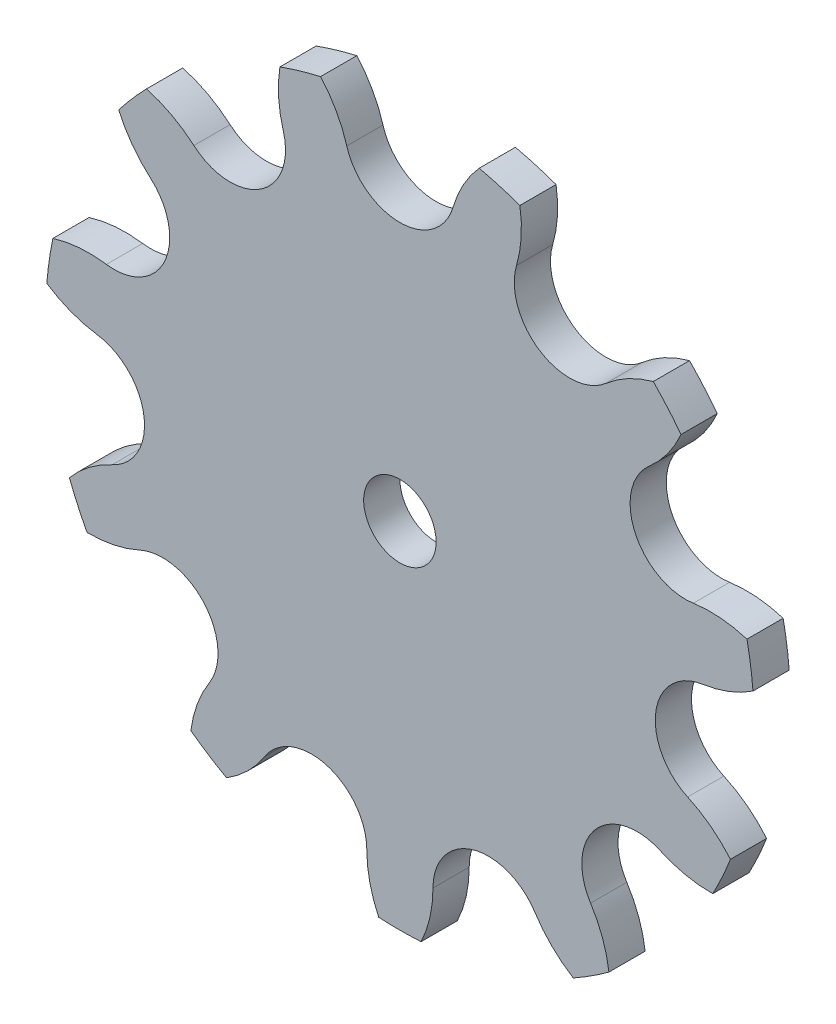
from build123d import *

# Parameters (mm, degrees)
SK_DISCO_R           = 25.436113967
SK_DISCO_R_2         = 2.6
DISCO_DEPTH          = 2.6
HUECO_DIENTE_DEPTH   = 37.065936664
MATRIZ_DIENTES_COUNT = 11


with BuildPart() as part:
    # Sk_Disco → Disco (new body)
    with BuildSketch(Plane.XY):
        Circle(SK_DISCO_R)
        Circle(SK_DISCO_R_2, mode=Mode.SUBTRACT)
    extrude(amount=DISCO_DEPTH)

    # Sk_Hueco → Hueco_diente (cut, through all)
    with BuildSketch(Plane.XY):
        with BuildLine():
            ThreePointArc((-3.81398457, 21.41921922), (0, 18.564106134), (3.81398457, 21.41921922))
            ThreePointArc((3.81398457, 21.41921922), (5.23928173, 24.240764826), (7.576378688, 26.369278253))
            ThreePointArc((7.576378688, 26.369278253), (0, 27.436113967), (-7.576378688, 26.369278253))
            ThreePointArc((-7.576378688, 26.369278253), (-5.23928173, 24.240764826), (-3.81398457, 21.41921922))
        make_face()
    hueco_diente = extrude(amount=HUECO_DIENTE_DEPTH, mode=Mode.SUBTRACT)

    # Matriz_dientes: Hueco_diente ×11 about axis
    matriz_dientes_axis = Axis((0, 0, 0), (0, 0, 1))
    for i in range(1, MATRIZ_DIENTES_COUNT):
        add(hueco_diente.rotate(matriz_dientes_axis, i * 360 / MATRIZ_DIENTES_COUNT), mode=Mode.SUBTRACT)


solid = part.part
